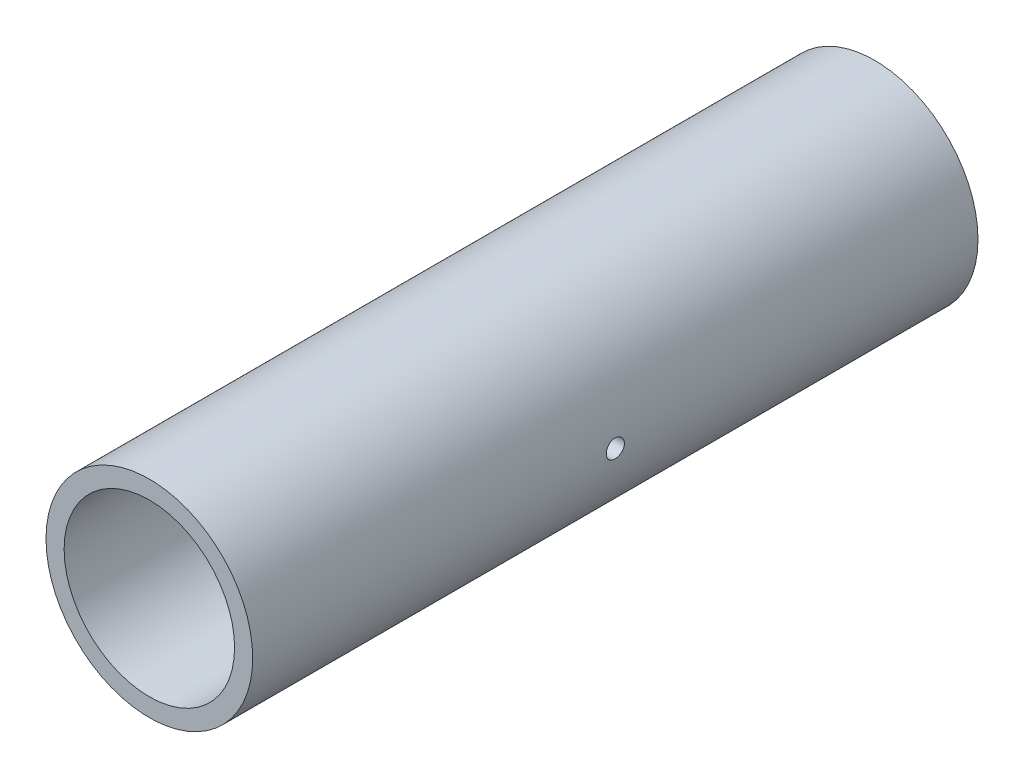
ISO-10303-21;
HEADER;
FILE_DESCRIPTION(('STEP AP214'),'2;1');
FILE_NAME('part.step','',(''),(''),'','','');
FILE_SCHEMA(('AUTOMOTIVE_DESIGN { 1 0 10303 214 1 1 1 1 }'));
ENDSEC;
DATA;
#1=APPLICATION_CONTEXT('core data for automotive mechanical design processes');
#2=APPLICATION_PROTOCOL_DEFINITION('international standard','automotive_design',2000,#1);
#3=PRODUCT_CONTEXT('',#1,'mechanical');
#4=PRODUCT('Part','Part','',(#3));
#5=PRODUCT_RELATED_PRODUCT_CATEGORY('part','',(#4));
#6=PRODUCT_DEFINITION_FORMATION('','',#4);
#7=PRODUCT_DEFINITION_CONTEXT('part definition',#1,'design');
#8=PRODUCT_DEFINITION('design','',#6,#7);
#9=PRODUCT_DEFINITION_SHAPE('','',#8);
#10=(LENGTH_UNIT() NAMED_UNIT(*) SI_UNIT(.MILLI.,.METRE.));
#11=(NAMED_UNIT(*) PLANE_ANGLE_UNIT() SI_UNIT($,.RADIAN.));
#12=(NAMED_UNIT(*) SI_UNIT($,.STERADIAN.) SOLID_ANGLE_UNIT());
#13=UNCERTAINTY_MEASURE_WITH_UNIT(LENGTH_MEASURE(1.E-05),#10,'distance_accuracy_value','');
#14=(GEOMETRIC_REPRESENTATION_CONTEXT(3) GLOBAL_UNCERTAINTY_ASSIGNED_CONTEXT((#13)) GLOBAL_UNIT_ASSIGNED_CONTEXT((#10,
#11,#12)) REPRESENTATION_CONTEXT('',''));
#15=CARTESIAN_POINT('',(0.,0.,0.));
#16=DIRECTION('',(0.,0.,1.));
#17=DIRECTION('',(1.,0.,0.));
#18=AXIS2_PLACEMENT_3D('',#15,#16,#17);
#19=CARTESIAN_POINT('',(0.,0.,200.));
#20=DIRECTION('',(0.,0.,1.));
#21=DIRECTION('',(1.,0.,0.));
#22=AXIS2_PLACEMENT_3D('',#19,#20,#21);
#23=PLANE('',#22);
#24=CARTESIAN_POINT('',(0.,0.,200.));
#25=DIRECTION('',(0.,0.,1.));
#26=DIRECTION('',(1.,0.,0.));
#27=AXIS2_PLACEMENT_3D('',#24,#25,#26);
#28=CIRCLE('',#27,28.5);
#29=CARTESIAN_POINT('',(28.5,0.,200.));
#30=VERTEX_POINT('',#29);
#31=EDGE_CURVE('E10',#30,#30,#28,.T.);
#32=ORIENTED_EDGE('',*,*,#31,.T.);
#33=EDGE_LOOP('',(#32));
#34=FACE_BOUND('',#33,.T.);
#35=CARTESIAN_POINT('',(0.,0.,200.));
#36=DIRECTION('',(0.,0.,1.));
#37=DIRECTION('',(1.,0.,0.));
#38=AXIS2_PLACEMENT_3D('',#35,#36,#37);
#39=CIRCLE('',#38,23.5);
#40=CARTESIAN_POINT('',(23.5,0.,200.));
#41=VERTEX_POINT('',#40);
#42=EDGE_CURVE('E54',#41,#41,#39,.T.);
#43=ORIENTED_EDGE('',*,*,#42,.F.);
#44=EDGE_LOOP('',(#43));
#45=FACE_BOUND('',#44,.T.);
#46=ADVANCED_FACE('F40',(#34,#45),#23,.T.);
#47=CARTESIAN_POINT('',(0.,0.,0.));
#48=DIRECTION('',(0.,0.,1.));
#49=DIRECTION('',(1.,0.,0.));
#50=AXIS2_PLACEMENT_3D('',#47,#48,#49);
#51=PLANE('',#50);
#52=CARTESIAN_POINT('',(0.,0.,0.));
#53=DIRECTION('',(0.,0.,1.));
#54=DIRECTION('',(1.,0.,0.));
#55=AXIS2_PLACEMENT_3D('',#52,#53,#54);
#56=CIRCLE('',#55,28.5);
#57=CARTESIAN_POINT('',(28.5,0.,0.));
#58=VERTEX_POINT('',#57);
#59=EDGE_CURVE('E45',#58,#58,#56,.T.);
#60=ORIENTED_EDGE('',*,*,#59,.F.);
#61=EDGE_LOOP('',(#60));
#62=FACE_BOUND('',#61,.T.);
#63=CARTESIAN_POINT('',(0.,0.,0.));
#64=DIRECTION('',(0.,0.,1.));
#65=DIRECTION('',(1.,0.,0.));
#66=AXIS2_PLACEMENT_3D('',#63,#64,#65);
#67=CIRCLE('',#66,23.5);
#68=CARTESIAN_POINT('',(23.5,0.,0.));
#69=VERTEX_POINT('',#68);
#70=EDGE_CURVE('E56',#69,#69,#67,.T.);
#71=ORIENTED_EDGE('',*,*,#70,.T.);
#72=EDGE_LOOP('',(#71));
#73=FACE_BOUND('',#72,.T.);
#74=ADVANCED_FACE('F88',(#62,#73),#51,.F.);
#75=CARTESIAN_POINT('',(0.,0.,200.));
#76=DIRECTION('',(0.,0.,-1.));
#77=DIRECTION('',(-1.,0.,0.));
#78=AXIS2_PLACEMENT_3D('',#75,#76,#77);
#79=CYLINDRICAL_SURFACE('',#78,28.5);
#80=CARTESIAN_POINT('',(28.5,0.,97.5));
#81=CARTESIAN_POINT('',(28.4999985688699,-0.14013712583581,97.5000061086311));
#82=CARTESIAN_POINT('',(28.4989553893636,-0.280368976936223,97.5118226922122));
#83=CARTESIAN_POINT('',(28.4948942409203,-0.556950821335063,97.558786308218));
#84=CARTESIAN_POINT('',(28.4918740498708,-0.693296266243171,97.5939595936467));
#85=CARTESIAN_POINT('',(28.4842000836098,-0.958059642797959,97.6866099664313));
#86=CARTESIAN_POINT('',(28.4795472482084,-1.08648208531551,97.7440742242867));
#87=CARTESIAN_POINT('',(28.4691294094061,-1.33182867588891,97.8796518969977));
#88=CARTESIAN_POINT('',(28.4633646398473,-1.44875523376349,97.9577609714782));
#89=CARTESIAN_POINT('',(28.4513514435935,-1.66814921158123,98.1326473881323));
#90=CARTESIAN_POINT('',(28.4451018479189,-1.77057988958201,98.2294707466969));
#91=CARTESIAN_POINT('',(28.4328331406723,-1.95775907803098,98.438939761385));
#92=CARTESIAN_POINT('',(28.4268140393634,-2.0425068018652,98.551586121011));
#93=CARTESIAN_POINT('',(28.4156754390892,-2.19204039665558,98.7897280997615));
#94=CARTESIAN_POINT('',(28.410557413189,-2.25679370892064,98.9152442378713));
#95=CARTESIAN_POINT('',(28.4018141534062,-2.36429241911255,99.1754200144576));
#96=CARTESIAN_POINT('',(28.3981888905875,-2.40703824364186,99.3100794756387));
#97=CARTESIAN_POINT('',(28.3928516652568,-2.46920134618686,99.5843493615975));
#98=CARTESIAN_POINT('',(28.3911347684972,-2.48867879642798,99.7239460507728));
#99=CARTESIAN_POINT('',(28.3897931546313,-2.50393817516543,100.004436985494));
#100=CARTESIAN_POINT('',(28.3901683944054,-2.49972059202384,100.145331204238));
#101=CARTESIAN_POINT('',(28.3929641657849,-2.4677593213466,100.424004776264));
#102=CARTESIAN_POINT('',(28.3953790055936,-2.44008110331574,100.561791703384));
#103=CARTESIAN_POINT('',(28.4019729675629,-2.36208599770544,100.830756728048));
#104=CARTESIAN_POINT('',(28.4061521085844,-2.31176886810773,100.961934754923));
#105=CARTESIAN_POINT('',(28.4158103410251,-2.1898512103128,101.214166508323));
#106=CARTESIAN_POINT('',(28.4212912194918,-2.11822138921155,101.33520600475));
#107=CARTESIAN_POINT('',(28.4329337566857,-1.95573275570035,101.563569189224));
#108=CARTESIAN_POINT('',(28.4390954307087,-1.86487351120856,101.670892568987));
#109=CARTESIAN_POINT('',(28.4514306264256,-1.66613836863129,101.869157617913));
#110=CARTESIAN_POINT('',(28.457604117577,-1.55820588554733,101.960042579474));
#111=CARTESIAN_POINT('',(28.4692475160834,-1.32858525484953,102.12241218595));
#112=CARTESIAN_POINT('',(28.4747174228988,-1.20689709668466,102.193896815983));
#113=CARTESIAN_POINT('',(28.4843385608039,-0.953181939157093,102.315433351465));
#114=CARTESIAN_POINT('',(28.4884896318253,-0.8211536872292,102.365482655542));
#115=CARTESIAN_POINT('',(28.4950036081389,-0.550523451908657,102.442687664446));
#116=CARTESIAN_POINT('',(28.4973665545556,-0.411921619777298,102.469843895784));
#117=CARTESIAN_POINT('',(28.5000327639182,-0.132570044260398,102.500420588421));
#118=CARTESIAN_POINT('',(28.5003428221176,0.00817106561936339,102.503919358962));
#119=CARTESIAN_POINT('',(28.4988864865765,0.288237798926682,102.487287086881));
#120=CARTESIAN_POINT('',(28.4971201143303,0.427563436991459,102.467156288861));
#121=CARTESIAN_POINT('',(28.4917138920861,0.700620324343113,102.40390123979));
#122=CARTESIAN_POINT('',(28.4880770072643,0.834360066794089,102.360813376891));
#123=CARTESIAN_POINT('',(28.4793381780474,1.09271209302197,102.252904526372));
#124=CARTESIAN_POINT('',(28.4742362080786,1.21732421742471,102.188083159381));
#125=CARTESIAN_POINT('',(28.4631218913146,1.45423953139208,102.038351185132));
#126=CARTESIAN_POINT('',(28.4571072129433,1.56650988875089,101.953388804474));
#127=CARTESIAN_POINT('',(28.4448507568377,1.77522307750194,101.765861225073));
#128=CARTESIAN_POINT('',(28.4386089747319,1.87166560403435,101.663295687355));
#129=CARTESIAN_POINT('',(28.4265815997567,2.04625490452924,101.443132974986));
#130=CARTESIAN_POINT('',(28.4207973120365,2.12435050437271,101.325495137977));
#131=CARTESIAN_POINT('',(28.4103587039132,2.25967799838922,101.07872907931));
#132=CARTESIAN_POINT('',(28.4057043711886,2.31691012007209,100.949600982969));
#133=CARTESIAN_POINT('',(28.3980602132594,2.40879924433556,100.683699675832));
#134=CARTESIAN_POINT('',(28.3950680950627,2.44348735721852,100.546937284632));
#135=CARTESIAN_POINT('',(28.3910796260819,2.48940500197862,100.269501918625));
#136=CARTESIAN_POINT('',(28.3900832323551,2.50063503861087,100.128829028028));
#137=CARTESIAN_POINT('',(28.3901997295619,2.4993116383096,99.848074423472));
#138=CARTESIAN_POINT('',(28.3913054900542,2.48683860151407,99.7079923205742));
#139=CARTESIAN_POINT('',(28.395486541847,2.43863099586,99.4319209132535));
#140=CARTESIAN_POINT('',(28.398561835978,2.4028963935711,99.2959316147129));
#141=CARTESIAN_POINT('',(28.4063335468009,2.30920086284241,99.0319022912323));
#142=CARTESIAN_POINT('',(28.41102984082,2.2512416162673,98.9038616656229));
#143=CARTESIAN_POINT('',(28.4215146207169,2.11475083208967,98.6593145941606));
#144=CARTESIAN_POINT('',(28.4273030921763,2.03621956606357,98.542807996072));
#145=CARTESIAN_POINT('',(28.4393434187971,1.86051169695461,98.3242244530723));
#146=CARTESIAN_POINT('',(28.4455967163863,1.76327542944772,98.2221955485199));
#147=CARTESIAN_POINT('',(28.4578489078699,1.55302915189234,98.0358632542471));
#148=CARTESIAN_POINT('',(28.4638477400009,1.4400153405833,97.9515641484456));
#149=CARTESIAN_POINT('',(28.4749270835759,1.20118166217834,97.8029584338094));
#150=CARTESIAN_POINT('',(28.4800057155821,1.07533638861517,97.7386925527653));
#151=CARTESIAN_POINT('',(28.4886508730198,0.814681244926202,97.6322866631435));
#152=CARTESIAN_POINT('',(28.4922191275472,0.679881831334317,97.5901213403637));
#153=CARTESIAN_POINT('',(28.4965302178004,0.453579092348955,97.5397971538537));
#154=CARTESIAN_POINT('',(28.4978254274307,0.36352910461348,97.5248931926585));
#155=CARTESIAN_POINT('',(28.4995607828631,0.182332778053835,97.5049926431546));
#156=CARTESIAN_POINT('',(28.5000009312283,0.09118644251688,97.499996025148));
#157=CARTESIAN_POINT('',(28.5,0.,97.5));
#158=B_SPLINE_CURVE_WITH_KNOTS('',3,(#80,#81,#82,#83,#84,#85,#86,#87,#88,#89,#90,#91,#92,#93,
#94,#95,#96,#97,#98,#99,#100,#101,#102,#103,#104,#105,#106,#107,#108,#109,#110,#111,#112,#113,
#114,#115,#116,#117,#118,#119,#120,#121,#122,#123,#124,#125,#126,#127,#128,#129,#130,#131,#132,
#133,#134,#135,#136,#137,#138,#139,#140,#141,#142,#143,#144,#145,#146,#147,#148,#149,#150,#151,
#152,#153,#154,#155,#156,#157),.UNSPECIFIED.,.T.,.F.,(4,2,2,2,2,2,2,2,2,2,2,2,2,2,2,2,2,2,2,2,2,
2,2,2,2,2,2,2,2,2,2,2,2,2,2,2,2,2,4),(0.,0.420078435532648,0.840629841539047,1.26093955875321,
1.68116098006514,2.10242913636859,2.52371602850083,2.94568536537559,3.36764652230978,
3.78851410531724,4.20937301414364,4.62906132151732,5.04875411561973,5.46902643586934,
5.88930820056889,6.31101325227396,6.73271862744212,7.15447516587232,7.57622200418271,
7.99657211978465,8.4169178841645,8.83659935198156,9.25628814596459,9.67706769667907,
10.0978553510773,10.5198031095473,10.9417462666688,11.3631059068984,11.7844564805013,
12.20438039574,12.6243049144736,13.0441976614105,13.4640848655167,13.8853343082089,
14.3066854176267,14.7288876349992,15.1506051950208,15.4239486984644,15.6972913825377),.UNSPECIFIED.);
#159=CARTESIAN_POINT('',(28.5,0.,97.5));
#160=VERTEX_POINT('',#159);
#161=EDGE_CURVE('E60',#160,#160,#158,.T.);
#162=ORIENTED_EDGE('',*,*,#161,.T.);
#163=EDGE_LOOP('',(#162));
#164=FACE_BOUND('',#163,.T.);
#165=ORIENTED_EDGE('',*,*,#31,.F.);
#166=EDGE_LOOP('',(#165));
#167=FACE_BOUND('',#166,.T.);
#168=ORIENTED_EDGE('',*,*,#59,.T.);
#169=EDGE_LOOP('',(#168));
#170=FACE_BOUND('',#169,.T.);
#171=ADVANCED_FACE('F42',(#164,#167,#170),#79,.T.);
#172=CARTESIAN_POINT('',(0.,0.,200.));
#173=DIRECTION('',(0.,0.,-1.));
#174=DIRECTION('',(-1.,0.,0.));
#175=AXIS2_PLACEMENT_3D('',#172,#173,#174);
#176=CYLINDRICAL_SURFACE('',#175,23.5);
#177=CARTESIAN_POINT('',(23.5,0.,97.5));
#178=CARTESIAN_POINT('',(23.4999982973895,-0.140001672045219,97.5000060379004));
#179=CARTESIAN_POINT('',(23.4987356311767,-0.280094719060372,97.5117998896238));
#180=CARTESIAN_POINT('',(23.4938200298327,-0.556393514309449,97.5586679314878));
#181=CARTESIAN_POINT('',(23.4901644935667,-0.692594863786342,97.5937674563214));
#182=CARTESIAN_POINT('',(23.4808756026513,-0.957069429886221,97.6862105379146));
#183=CARTESIAN_POINT('',(23.4752434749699,-1.08534750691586,97.7435402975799));
#184=CARTESIAN_POINT('',(23.4626303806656,-1.33043350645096,97.8787888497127));
#185=CARTESIAN_POINT('',(23.4556496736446,-1.44724363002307,97.9567036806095));
#186=CARTESIAN_POINT('',(23.4410891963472,-1.6665777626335,98.131248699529));
#187=CARTESIAN_POINT('',(23.4335073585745,-1.76904879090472,98.227945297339));
#188=CARTESIAN_POINT('',(23.4186161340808,-1.95634035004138,98.4371670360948));
#189=CARTESIAN_POINT('',(23.4113067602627,-2.04116004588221,98.5496929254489));
#190=CARTESIAN_POINT('',(23.3977671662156,-2.190931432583,98.7877140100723));
#191=CARTESIAN_POINT('',(23.3915395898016,-2.25583473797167,98.9132398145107));
#192=CARTESIAN_POINT('',(23.3808948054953,-2.36362202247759,99.1734857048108));
#193=CARTESIAN_POINT('',(23.3764775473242,-2.40650661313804,99.3082055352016));
#194=CARTESIAN_POINT('',(23.3699725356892,-2.46888101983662,99.5824722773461));
#195=CARTESIAN_POINT('',(23.3678759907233,-2.48845914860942,99.7219988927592));
#196=CARTESIAN_POINT('',(23.3662226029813,-2.50393793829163,100.002372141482));
#197=CARTESIAN_POINT('',(23.3666656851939,-2.4998392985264,100.143218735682));
#198=CARTESIAN_POINT('',(23.3700334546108,-2.46815361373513,100.421623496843));
#199=CARTESIAN_POINT('',(23.372947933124,-2.44066319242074,100.559192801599));
#200=CARTESIAN_POINT('',(23.3809141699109,-2.36312473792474,100.827754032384));
#201=CARTESIAN_POINT('',(23.3859659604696,-2.31307636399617,100.958745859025));
#202=CARTESIAN_POINT('',(23.397649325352,-2.19173669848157,101.210737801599));
#203=CARTESIAN_POINT('',(23.404284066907,-2.12040274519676,101.331717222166));
#204=CARTESIAN_POINT('',(23.4183831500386,-1.95854745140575,101.560023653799));
#205=CARTESIAN_POINT('',(23.425847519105,-1.86802547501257,101.667350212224));
#206=CARTESIAN_POINT('',(23.4408102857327,-1.66982503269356,101.865865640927));
#207=CARTESIAN_POINT('',(23.4483086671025,-1.562063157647,101.956971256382));
#208=CARTESIAN_POINT('',(23.4624594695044,-1.33273093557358,102.11981266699));
#209=CARTESIAN_POINT('',(23.4691118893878,-1.21116056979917,102.191548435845));
#210=CARTESIAN_POINT('',(23.4808238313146,-0.957603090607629,102.313611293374));
#211=CARTESIAN_POINT('',(23.4858830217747,-0.825613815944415,102.363933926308));
#212=CARTESIAN_POINT('',(23.4938351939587,-0.554993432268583,102.441679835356));
#213=CARTESIAN_POINT('',(23.4967282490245,-0.416362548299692,102.469103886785));
#214=CARTESIAN_POINT('',(23.5000127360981,-0.137114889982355,102.500168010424));
#215=CARTESIAN_POINT('',(23.5004162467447,0.0034889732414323,102.503922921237));
#216=CARTESIAN_POINT('',(23.4987086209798,0.283323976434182,102.487844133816));
#217=CARTESIAN_POINT('',(23.4965975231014,0.422555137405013,102.46801079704));
#218=CARTESIAN_POINT('',(23.4901055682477,0.695359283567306,102.405413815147));
#219=CARTESIAN_POINT('',(23.4857300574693,0.82894479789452,102.362704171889));
#220=CARTESIAN_POINT('',(23.4751998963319,1.08705569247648,102.25562259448));
#221=CARTESIAN_POINT('',(23.4690452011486,1.21158084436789,102.191250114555));
#222=CARTESIAN_POINT('',(23.4556144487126,1.44855394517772,102.042386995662));
#223=CARTESIAN_POINT('',(23.4483342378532,1.56095442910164,101.957821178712));
#224=CARTESIAN_POINT('',(23.4334820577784,1.77000651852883,101.771079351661));
#225=CARTESIAN_POINT('',(23.4259100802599,1.86665767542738,101.668902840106));
#226=CARTESIAN_POINT('',(23.4112912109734,2.04186832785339,101.449337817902));
#227=CARTESIAN_POINT('',(23.4042465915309,2.12035227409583,101.331888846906));
#228=CARTESIAN_POINT('',(23.3915153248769,2.25648067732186,101.085409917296));
#229=CARTESIAN_POINT('',(23.3858286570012,2.31412545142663,100.956380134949));
#230=CARTESIAN_POINT('',(23.3764716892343,2.40681367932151,100.690657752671));
#231=CARTESIAN_POINT('',(23.372797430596,2.44190153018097,100.553980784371));
#232=CARTESIAN_POINT('',(23.3678692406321,2.48862371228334,100.276633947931));
#233=CARTESIAN_POINT('',(23.3666152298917,2.50025881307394,100.135964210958));
#234=CARTESIAN_POINT('',(23.366671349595,2.49973373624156,99.8553759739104));
#235=CARTESIAN_POINT('',(23.3679686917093,2.48769223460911,99.7154572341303));
#236=CARTESIAN_POINT('',(23.3729540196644,2.44040517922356,99.4396428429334));
#237=CARTESIAN_POINT('',(23.3766420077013,2.40515960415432,99.3037471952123));
#238=CARTESIAN_POINT('',(23.3859894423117,2.3124987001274,99.039840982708));
#239=CARTESIAN_POINT('',(23.3916485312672,2.25508739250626,98.9118289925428));
#240=CARTESIAN_POINT('',(23.4043012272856,2.1197367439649,98.667238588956));
#241=CARTESIAN_POINT('',(23.411294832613,2.04179742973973,98.5506601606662));
#242=CARTESIAN_POINT('',(23.4258705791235,1.86715846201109,98.3316380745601));
#243=CARTESIAN_POINT('',(23.4334553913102,1.77037030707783,98.2292651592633));
#244=CARTESIAN_POINT('',(23.4483346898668,1.56095957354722,98.0421639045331));
#245=CARTESIAN_POINT('',(23.4556291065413,1.44833322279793,97.9574397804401));
#246=CARTESIAN_POINT('',(23.4691274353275,1.21009178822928,97.807849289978));
#247=CARTESIAN_POINT('',(23.4753282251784,1.08444109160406,97.7430393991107));
#248=CARTESIAN_POINT('',(23.4859074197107,0.824052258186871,97.6355264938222));
#249=CARTESIAN_POINT('',(23.4902878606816,0.689324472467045,97.5927987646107));
#250=CARTESIAN_POINT('',(23.495642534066,0.461540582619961,97.5412180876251));
#251=CARTESIAN_POINT('',(23.4972688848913,0.369936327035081,97.5257826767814));
#252=CARTESIAN_POINT('',(23.4994481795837,0.185568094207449,97.5051716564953));
#253=CARTESIAN_POINT('',(23.5000011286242,0.0928041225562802,97.4999959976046));
#254=CARTESIAN_POINT('',(23.5,0.,97.5));
#255=B_SPLINE_CURVE_WITH_KNOTS('',3,(#177,#178,#179,#180,#181,#182,#183,#184,#185,#186,#187,
#188,#189,#190,#191,#192,#193,#194,#195,#196,#197,#198,#199,#200,#201,#202,#203,#204,#205,#206,
#207,#208,#209,#210,#211,#212,#213,#214,#215,#216,#217,#218,#219,#220,#221,#222,#223,#224,#225,
#226,#227,#228,#229,#230,#231,#232,#233,#234,#235,#236,#237,#238,#239,#240,#241,#242,#243,#244,
#245,#246,#247,#248,#249,#250,#251,#252,#253,#254),.UNSPECIFIED.,.T.,.F.,(4,2,2,2,2,2,2,2,2,2,2,
2,2,2,2,2,2,2,2,2,2,2,2,2,2,2,2,2,2,2,2,2,2,2,2,2,2,2,4),(0.,0.419666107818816,
0.839789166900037,1.25965189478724,1.67943387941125,2.10072810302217,2.52204225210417,
2.94437199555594,3.36669000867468,3.78740263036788,4.20810282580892,4.62707363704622,
5.04605077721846,5.46587335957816,5.88570985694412,6.30764268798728,6.72957609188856,
7.15159725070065,7.57360411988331,7.99356189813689,8.41351324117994,8.8324775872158,
9.25145248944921,9.67201220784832,10.0925839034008,10.5148743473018,10.9371583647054,
11.3586086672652,11.7800451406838,12.1993746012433,12.6187044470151,13.0379582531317,
13.4572115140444,13.8784829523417,14.2998548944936,14.7224110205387,15.1444931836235,
15.4226822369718,15.7008699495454),.UNSPECIFIED.);
#256=CARTESIAN_POINT('',(23.5,0.,97.5));
#257=VERTEX_POINT('',#256);
#258=EDGE_CURVE('E71',#257,#257,#255,.T.);
#259=ORIENTED_EDGE('',*,*,#258,.F.);
#260=EDGE_LOOP('',(#259));
#261=FACE_BOUND('',#260,.T.);
#262=ORIENTED_EDGE('',*,*,#42,.T.);
#263=EDGE_LOOP('',(#262));
#264=FACE_BOUND('',#263,.T.);
#265=ORIENTED_EDGE('',*,*,#70,.F.);
#266=EDGE_LOOP('',(#265));
#267=FACE_BOUND('',#266,.T.);
#268=ADVANCED_FACE('F79',(#261,#264,#267),#176,.F.);
#269=CARTESIAN_POINT('',(28.5,0.,100.));
#270=DIRECTION('',(1.,0.,0.));
#271=DIRECTION('',(0.,0.,-1.));
#272=AXIS2_PLACEMENT_3D('',#269,#270,#271);
#273=CYLINDRICAL_SURFACE('',#272,2.5);
#274=ORIENTED_EDGE('',*,*,#258,.T.);
#275=EDGE_LOOP('',(#274));
#276=FACE_BOUND('',#275,.T.);
#277=ORIENTED_EDGE('',*,*,#161,.F.);
#278=EDGE_LOOP('',(#277));
#279=FACE_BOUND('',#278,.T.);
#280=ADVANCED_FACE('F76',(#276,#279),#273,.F.);
#281=CLOSED_SHELL('',(#46,#74,#171,#268,#280));
#282=MANIFOLD_SOLID_BREP('B2',#281);
#283=ADVANCED_BREP_SHAPE_REPRESENTATION('',(#18,#282),#14);
#284=SHAPE_DEFINITION_REPRESENTATION(#9,#283);
ENDSEC;
END-ISO-10303-21;
